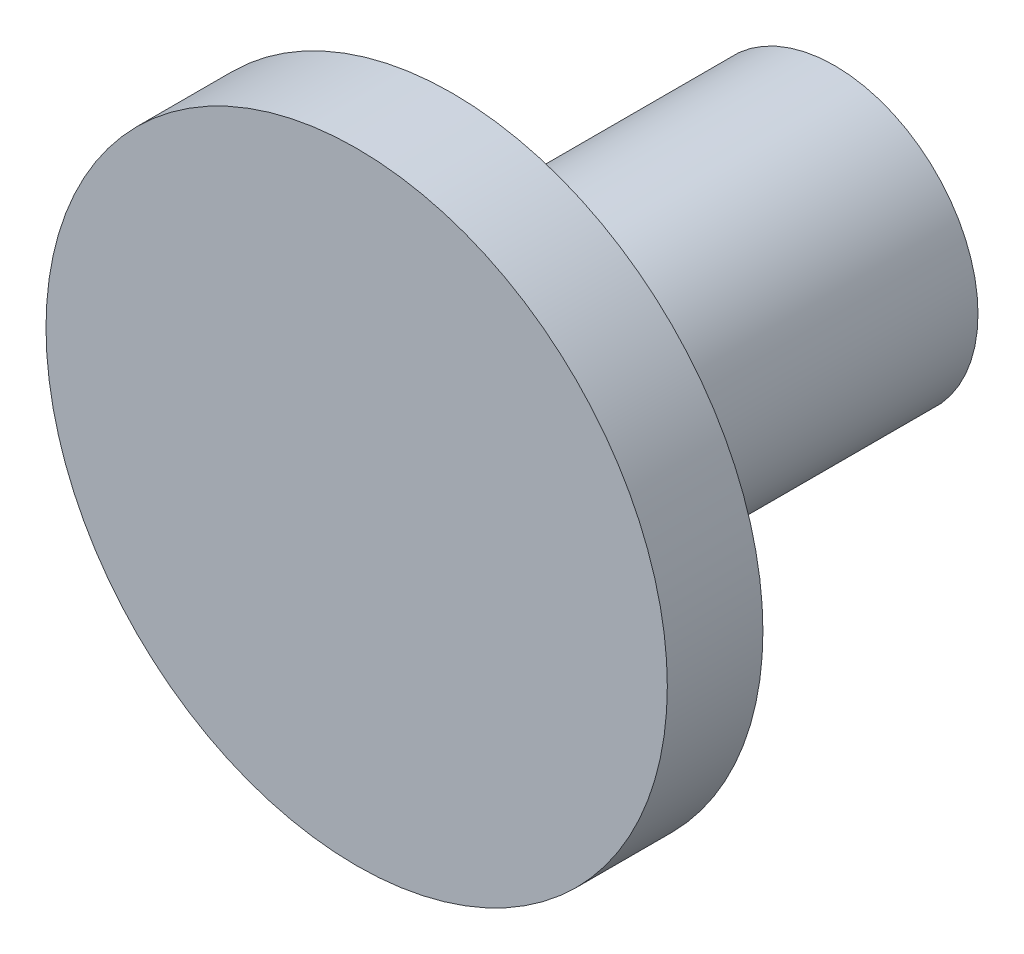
ISO-10303-21;
HEADER;
FILE_DESCRIPTION(('STEP AP214'),'2;1');
FILE_NAME('part.step','',(''),(''),'','','');
FILE_SCHEMA(('AUTOMOTIVE_DESIGN { 1 0 10303 214 1 1 1 1 }'));
ENDSEC;
DATA;
#1=APPLICATION_CONTEXT('core data for automotive mechanical design processes');
#2=APPLICATION_PROTOCOL_DEFINITION('international standard','automotive_design',2000,#1);
#3=PRODUCT_CONTEXT('',#1,'mechanical');
#4=PRODUCT('Part','Part','',(#3));
#5=PRODUCT_RELATED_PRODUCT_CATEGORY('part','',(#4));
#6=PRODUCT_DEFINITION_FORMATION('','',#4);
#7=PRODUCT_DEFINITION_CONTEXT('part definition',#1,'design');
#8=PRODUCT_DEFINITION('design','',#6,#7);
#9=PRODUCT_DEFINITION_SHAPE('','',#8);
#10=(LENGTH_UNIT() NAMED_UNIT(*) SI_UNIT(.MILLI.,.METRE.));
#11=(NAMED_UNIT(*) PLANE_ANGLE_UNIT() SI_UNIT($,.RADIAN.));
#12=(NAMED_UNIT(*) SI_UNIT($,.STERADIAN.) SOLID_ANGLE_UNIT());
#13=UNCERTAINTY_MEASURE_WITH_UNIT(LENGTH_MEASURE(1.E-05),#10,'distance_accuracy_value','');
#14=(GEOMETRIC_REPRESENTATION_CONTEXT(3) GLOBAL_UNCERTAINTY_ASSIGNED_CONTEXT((#13)) GLOBAL_UNIT_ASSIGNED_CONTEXT((#10,
#11,#12)) REPRESENTATION_CONTEXT('',''));
#15=CARTESIAN_POINT('',(0.,0.,0.));
#16=DIRECTION('',(0.,0.,1.));
#17=DIRECTION('',(1.,0.,0.));
#18=AXIS2_PLACEMENT_3D('',#15,#16,#17);
#19=CARTESIAN_POINT('',(19.,0.,-4.));
#20=DIRECTION('',(0.,0.,1.));
#21=DIRECTION('',(1.,0.,0.));
#22=AXIS2_PLACEMENT_3D('',#19,#20,#21);
#23=CYLINDRICAL_SURFACE('',#22,1.5);
#24=CARTESIAN_POINT('',(19.,0.,-4.));
#25=DIRECTION('',(0.,0.,1.));
#26=DIRECTION('',(1.,0.,0.));
#27=AXIS2_PLACEMENT_3D('',#24,#25,#26);
#28=CIRCLE('',#27,1.5);
#29=CARTESIAN_POINT('',(20.5,0.,-4.));
#30=VERTEX_POINT('',#29);
#31=EDGE_CURVE('E10',#30,#30,#28,.T.);
#32=ORIENTED_EDGE('',*,*,#31,.T.);
#33=EDGE_LOOP('',(#32));
#34=FACE_BOUND('',#33,.T.);
#35=CARTESIAN_POINT('',(19.,0.,0.));
#36=DIRECTION('',(0.,0.,1.));
#37=DIRECTION('',(1.,0.,0.));
#38=AXIS2_PLACEMENT_3D('',#35,#36,#37);
#39=CIRCLE('',#38,1.5);
#40=CARTESIAN_POINT('',(20.5,0.,0.));
#41=VERTEX_POINT('',#40);
#42=EDGE_CURVE('E37',#41,#41,#39,.T.);
#43=ORIENTED_EDGE('',*,*,#42,.F.);
#44=EDGE_LOOP('',(#43));
#45=FACE_BOUND('',#44,.T.);
#46=ADVANCED_FACE('F31',(#34,#45),#23,.T.);
#47=CARTESIAN_POINT('',(19.,0.,-4.));
#48=DIRECTION('',(0.,0.,1.));
#49=DIRECTION('',(1.,0.,0.));
#50=AXIS2_PLACEMENT_3D('',#47,#48,#49);
#51=PLANE('',#50);
#52=ORIENTED_EDGE('',*,*,#31,.F.);
#53=EDGE_LOOP('',(#52));
#54=FACE_BOUND('',#53,.T.);
#55=ADVANCED_FACE('F63',(#54),#51,.F.);
#56=CARTESIAN_POINT('',(19.,0.,1.));
#57=DIRECTION('',(0.,0.,-1.));
#58=DIRECTION('',(-1.,0.,0.));
#59=AXIS2_PLACEMENT_3D('',#56,#57,#58);
#60=CYLINDRICAL_SURFACE('',#59,3.25);
#61=CARTESIAN_POINT('',(19.,0.,1.));
#62=DIRECTION('',(0.,0.,1.));
#63=DIRECTION('',(1.,0.,0.));
#64=AXIS2_PLACEMENT_3D('',#61,#62,#63);
#65=CIRCLE('',#64,3.25);
#66=CARTESIAN_POINT('',(22.25,0.,1.));
#67=VERTEX_POINT('',#66);
#68=EDGE_CURVE('E41',#67,#67,#65,.T.);
#69=ORIENTED_EDGE('',*,*,#68,.F.);
#70=EDGE_LOOP('',(#69));
#71=FACE_BOUND('',#70,.T.);
#72=CARTESIAN_POINT('',(19.,0.,0.));
#73=DIRECTION('',(0.,0.,1.));
#74=DIRECTION('',(1.,0.,0.));
#75=AXIS2_PLACEMENT_3D('',#72,#73,#74);
#76=CIRCLE('',#75,3.25);
#77=CARTESIAN_POINT('',(22.25,0.,0.));
#78=VERTEX_POINT('',#77);
#79=EDGE_CURVE('E45',#78,#78,#76,.T.);
#80=ORIENTED_EDGE('',*,*,#79,.T.);
#81=EDGE_LOOP('',(#80));
#82=FACE_BOUND('',#81,.T.);
#83=ADVANCED_FACE('F51',(#71,#82),#60,.T.);
#84=CARTESIAN_POINT('',(19.,0.,1.));
#85=DIRECTION('',(0.,0.,1.));
#86=DIRECTION('',(1.,0.,0.));
#87=AXIS2_PLACEMENT_3D('',#84,#85,#86);
#88=PLANE('',#87);
#89=ORIENTED_EDGE('',*,*,#68,.T.);
#90=EDGE_LOOP('',(#89));
#91=FACE_BOUND('',#90,.T.);
#92=ADVANCED_FACE('F55',(#91),#88,.T.);
#93=CARTESIAN_POINT('',(19.,0.,0.));
#94=DIRECTION('',(0.,0.,1.));
#95=DIRECTION('',(1.,0.,0.));
#96=AXIS2_PLACEMENT_3D('',#93,#94,#95);
#97=PLANE('',#96);
#98=ORIENTED_EDGE('',*,*,#42,.T.);
#99=EDGE_LOOP('',(#98));
#100=FACE_BOUND('',#99,.T.);
#101=ORIENTED_EDGE('',*,*,#79,.F.);
#102=EDGE_LOOP('',(#101));
#103=FACE_BOUND('',#102,.T.);
#104=ADVANCED_FACE('F53',(#100,#103),#97,.F.);
#105=CLOSED_SHELL('',(#46,#55,#83,#92,#104));
#106=MANIFOLD_SOLID_BREP('B2',#105);
#107=ADVANCED_BREP_SHAPE_REPRESENTATION('',(#18,#106),#14);
#108=SHAPE_DEFINITION_REPRESENTATION(#9,#107);
ENDSEC;
END-ISO-10303-21;
